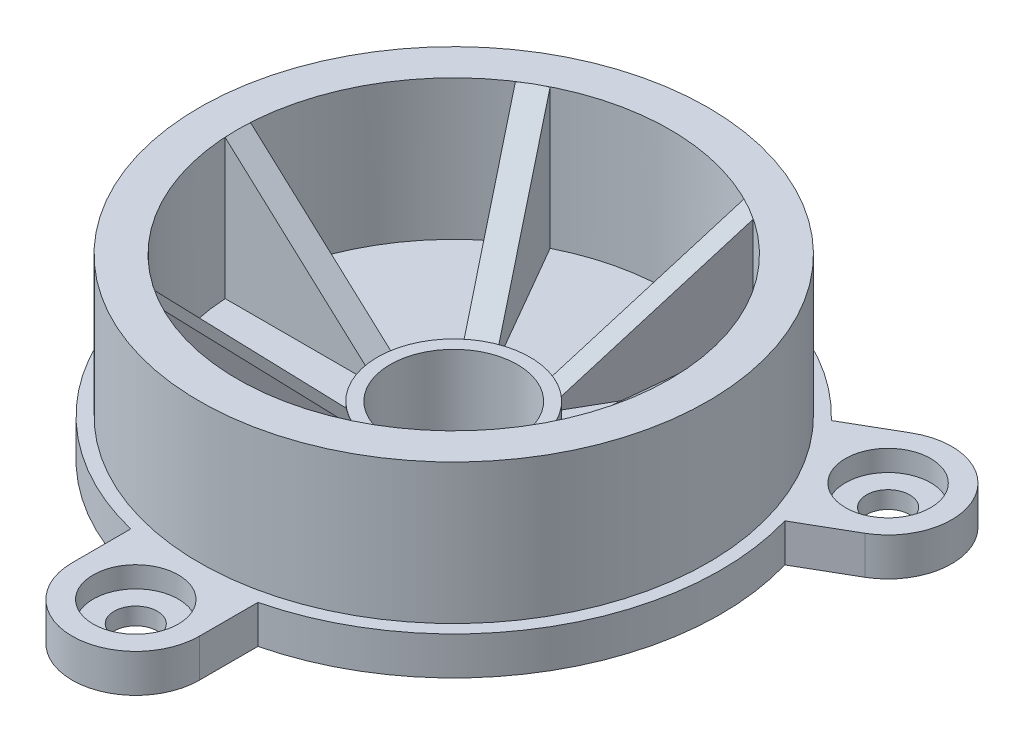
from build123d import *

# Parameters (mm, degrees)
EXTRUDE1_DEPTH                  = 3
CBORE_FOR_M3_SBHCS1_D           = 3.4
CBORE_FOR_M3_SBHCS1_CBORE_D     = 6.7
CBORE_FOR_M3_SBHCS1_CBORE_DEPTH = 1.65
CIRPATTERN1_COUNT               = 3
RIB1_REACH                      = 45.2
SKETCH5_WALL_W                  = 103.26644724
SKETCH5_WALL_H                  = 2
CIRPATTERN2_COUNT               = 6


with BuildPart() as part:
    # Sketch1 → Revolve1 (revolve)
    with BuildSketch(Plane(origin=(0, 0, 0), x_dir=(0, 0, -1), z_dir=(1, 0, 0))):
        Polygon((5, 0), (10, 0), (10, 2), (21, 2), (21, 5), (20, 5), (20, 16), (17, 16), (17, 5), (6, 5), (6, 6), (5, 6), align=None)
    revolve(axis=Axis((0, 0, 0), (0, 1, 0)))

    # Sketch2 → Extrude1 (add)
    with BuildSketch(Plane(origin=(0, 5, 0), x_dir=(1, 0, 0), z_dir=(0, 1, 0))):
        with BuildLine():
            Line((-5, -20.396078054), (-5, -25))
            ThreePointArc((-5, -25), (0, -30), (5, -25))
            Line((5, -25), (5, -20.396078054))
            ThreePointArc((5, -20.396078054), (0, -21), (-5, -20.396078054))
        make_face()
    extrude1 = extrude(amount=-EXTRUDE1_DEPTH)

    # CBORE for M3 SBHCS1 (through all)
    with Locations(Plane(origin=(0, 5, 0), x_dir=(-1, 0, 0), z_dir=(0, 1, 0))):
        with Locations((0, 25)):
            cbore_for_m3_sbhcs1 = CounterBoreHole(CBORE_FOR_M3_SBHCS1_D / 2, CBORE_FOR_M3_SBHCS1_CBORE_D / 2, CBORE_FOR_M3_SBHCS1_CBORE_DEPTH)

    # CirPattern1: Extrude1, CBORE for M3 SBHCS1 ×3 about axis
    cirpattern1_axis = Axis((0, 0, 0), (0, 1, 0))
    add([extrude1.rotate(cirpattern1_axis, i * 360 / CIRPATTERN1_COUNT) for i in range(1, CIRPATTERN1_COUNT)])
    add([cbore_for_m3_sbhcs1.rotate(cirpattern1_axis, i * 360 / CIRPATTERN1_COUNT) for i in range(1, CIRPATTERN1_COUNT)], mode=Mode.SUBTRACT)

    # Sketch5 wall → Rib1 (add, up to next)
    with BuildSketch(Plane(origin=(-11.5, 11, 0), x_dir=(0.739940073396, -0.672672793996, 0), z_dir=(0.672672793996, 0.739940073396, 0)), mode=Mode.PRIVATE) as rib1_sk1:
        Rectangle(SKETCH5_WALL_W, SKETCH5_WALL_H)
    rib1_tool1 = extrude(rib1_sk1.sketch, amount=-RIB1_REACH, mode=Mode.PRIVATE) - part.part
    rib1 = rib1_tool1.solids().sort_by_distance((-11.5, 11, 0))[0]
    add(rib1)

    # CirPattern2: Rib1 ×6 about axis
    cirpattern2_axis = Axis((0, 0, 0), (0, 1, 0))
    for i in range(1, CIRPATTERN2_COUNT):
        add(rib1.rotate(cirpattern2_axis, i * 360 / CIRPATTERN2_COUNT))


solid = part.part
